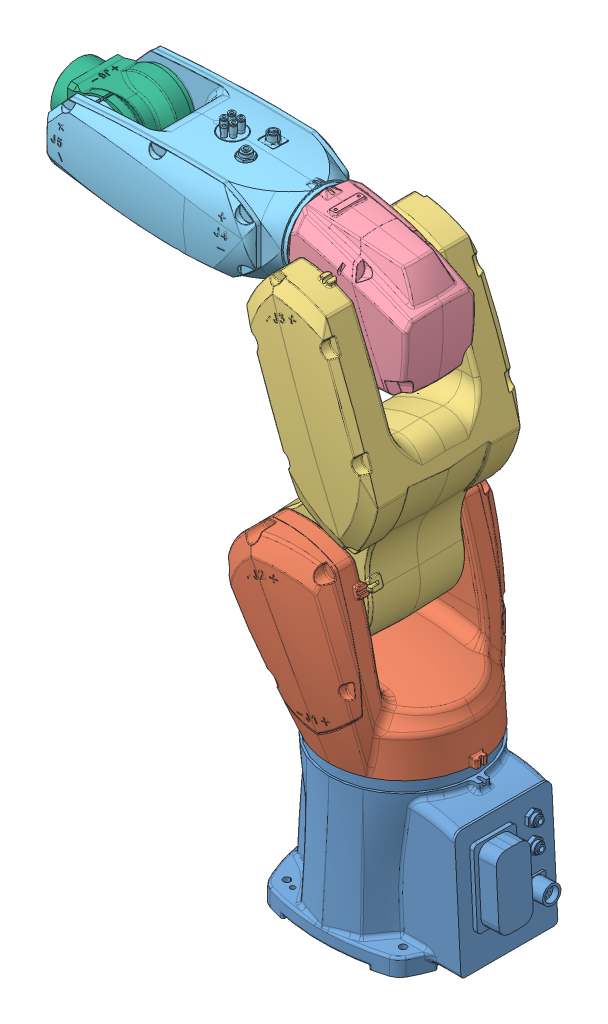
SolidWorks assembly 市场3D模型.SLDASM, configuration 0位 (file format 9000). Lengths in mm.
Overall size (593.13 763.6 258.12).
7 component instances, 7 part files, 12 mates.
Components (placement in the parent):
- 底座-1: 底座.sldprt [默认] at origin size (273.13 204 212)
- 旋转座-1: 旋转座.sldprt [默认] at (0 200.5 -62.5) x (1 0 0) z (0 -1 0) size (254.17 258.12 239.65)
- 大臂-1: 大臂.sldprt [默认] at (-50 366 -124.5) x (-1 0 0) z (0 0 -1) size (201.2 420.73 216.71)
- 肘部-1: 肘部.sldprt [默认] at (-102 696 -62.5) x (0 0 1) z (-1 0 0) size (124.8 182.35 161.55)
- 小臂-1: 小臂.sldprt [默认] at (-103 696 -62.5) x (0 0 -1) z (1 0 0) size (152.35 132.68 300.6)
- 腕体-1: 腕体.sldprt [默认] at (-350 696 -62.5) x (-1 0 0) z (0 0 1) size (112.5 86.12 77.5)
- 腕体法兰-1: 腕体法兰.sldprt [默认] at (-350 696 -62.5) x (-1 0 0) z (0 -0.017977 0.999838) size (10.5 51 51)
Mates (geometry in assembly coordinates):
- 距离1: distance = 14.5 mm anti-aligned: plane of 旋转座-1 through (50 200.5 -62.5) normal (0 -1 0); plane of 底座-1 through (-92.5 186 -62.5) normal (0 1 0)
- 同心1: concentric aligned: cylinder of 底座-1 through (0 43 -62.5) axis (0 -1 0) radius 92.5; cylinder of 旋转座-1 through (0 215.5 -62.5) axis (0 -1 0) radius 75
- 距离2: distance = 4 mm anti-aligned: plane of 大臂-1 through (4.8179 472.1043 -0.5) normal (0 0 1); plane of 旋转座-1 through (150 446.7893 3.5) normal (0 0 -1)
- 同心2: concentric aligned: circle of 大臂-1; circle of 旋转座-1
- 距离3: distance = 2 mm anti-aligned: plane of 肘部-1 through (-50 651 -14.5) normal (0 0 1); plane of 大臂-1 through (-50 651 -12.5) normal (0 0 -1)
- 同心3: concentric anti-aligned: circle of 大臂-1; cylinder of 肘部-1 through (-50 651 -12.5) axis (0 0 -1) radius 32.5
- 距离4: distance = 1 mm anti-aligned: plane of 肘部-1 through (-102 696 -62.5) normal (-1 0 0); plane of 小臂-1 through (-103 696 -62.5) normal (1 0 0)
- 同心4: concentric anti-aligned: cylinder of 小臂-1 through (-105.5 696 -62.5) axis (-1 0 0) radius 47; cylinder of 肘部-1 through (-103 696 -62.5) axis (1 0 0) radius 42.5
- 距离5: distance = 3.5 mm anti-aligned: plane of 小臂-1 through (-379.5 696 -24) normal (0 0 -1); plane of 腕体-1 through (-393 696 -27.5) normal (0 0 1)
- 同心5: concentric anti-aligned: cylinder of 小臂-1 through (-350 696 -109.5) axis (0 0 -1) radius 33; cylinder of 腕体-1 through (-350 696 -104.5) axis (0 0 1) radius 40
- 同心6: concentric aligned: cylinder of 腕体-1 through (-419.5 696 -62.5) axis (1 0 0) radius 35; cylinder of 腕体法兰-1 through (-426.5 696 -62.5) axis (1 0 0) radius 25.5
- 距离6: distance = 7 mm aligned: plane of 腕体法兰-1 through (-426.5 696 -62.5) normal (-1 0 0); plane of 腕体-1 through (-419.5 696 -62.5) normal (-1 0 0)
